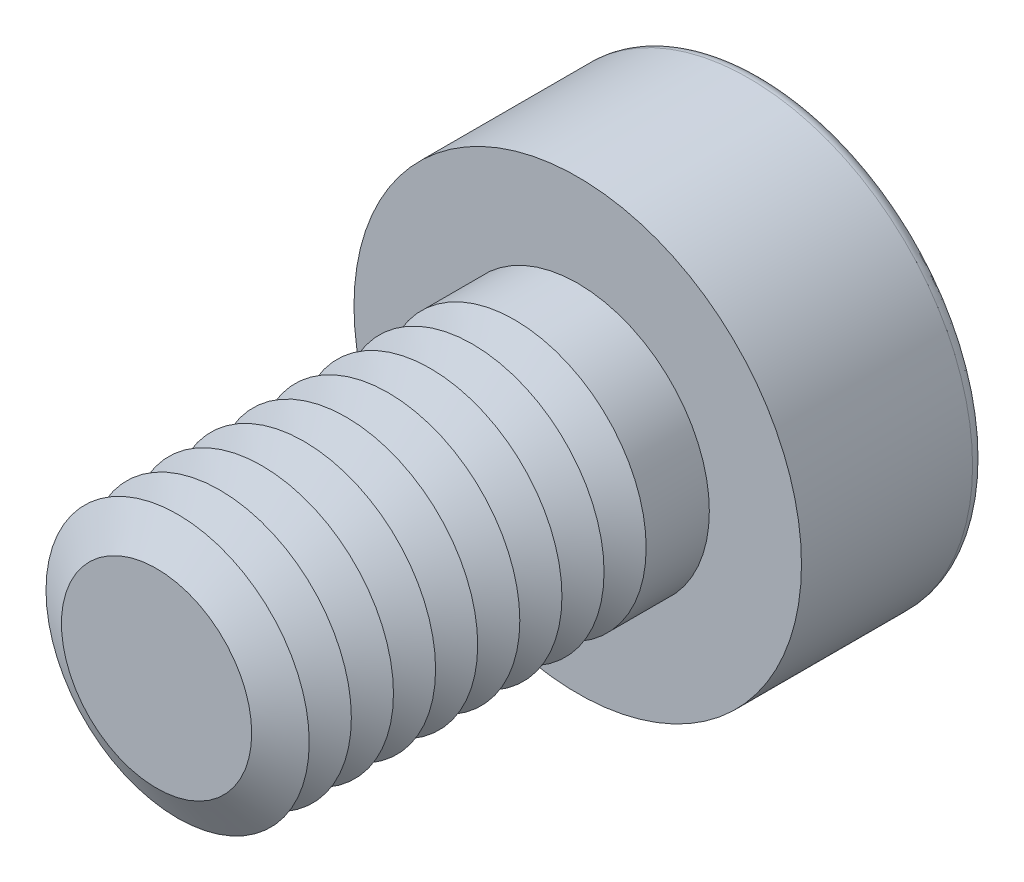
ISO-10303-21;
HEADER;
FILE_DESCRIPTION(('STEP AP214'),'2;1');
FILE_NAME('part.step','',(''),(''),'','','');
FILE_SCHEMA(('AUTOMOTIVE_DESIGN { 1 0 10303 214 1 1 1 1 }'));
ENDSEC;
DATA;
#1=APPLICATION_CONTEXT('core data for automotive mechanical design processes');
#2=APPLICATION_PROTOCOL_DEFINITION('international standard','automotive_design',2000,#1);
#3=PRODUCT_CONTEXT('',#1,'mechanical');
#4=PRODUCT('Part','Part','',(#3));
#5=PRODUCT_RELATED_PRODUCT_CATEGORY('part','',(#4));
#6=PRODUCT_DEFINITION_FORMATION('','',#4);
#7=PRODUCT_DEFINITION_CONTEXT('part definition',#1,'design');
#8=PRODUCT_DEFINITION('design','',#6,#7);
#9=PRODUCT_DEFINITION_SHAPE('','',#8);
#10=(LENGTH_UNIT() NAMED_UNIT(*) SI_UNIT(.MILLI.,.METRE.));
#11=(NAMED_UNIT(*) PLANE_ANGLE_UNIT() SI_UNIT($,.RADIAN.));
#12=(NAMED_UNIT(*) SI_UNIT($,.STERADIAN.) SOLID_ANGLE_UNIT());
#13=UNCERTAINTY_MEASURE_WITH_UNIT(LENGTH_MEASURE(1.E-05),#10,'distance_accuracy_value','');
#14=(GEOMETRIC_REPRESENTATION_CONTEXT(3) GLOBAL_UNCERTAINTY_ASSIGNED_CONTEXT((#13)) GLOBAL_UNIT_ASSIGNED_CONTEXT((#10,
#11,#12)) REPRESENTATION_CONTEXT('',''));
#15=CARTESIAN_POINT('',(0.,0.,0.));
#16=DIRECTION('',(0.,0.,1.));
#17=DIRECTION('',(1.,0.,0.));
#18=AXIS2_PLACEMENT_3D('',#15,#16,#17);
#19=CARTESIAN_POINT('',(0.,0.,5.2));
#20=DIRECTION('',(0.,0.,1.));
#21=DIRECTION('',(1.,0.,0.));
#22=AXIS2_PLACEMENT_3D('',#19,#20,#21);
#23=CONICAL_SURFACE('',#22,2.5,1.0471975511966);
#24=CARTESIAN_POINT('',(0.,0.,4.8));
#25=DIRECTION('',(0.,0.,1.));
#26=DIRECTION('',(1.,0.,0.));
#27=AXIS2_PLACEMENT_3D('',#24,#25,#26);
#28=CIRCLE('',#27,1.80717967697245);
#29=CARTESIAN_POINT('',(1.80717967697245,0.,4.8));
#30=VERTEX_POINT('',#29);
#31=EDGE_CURVE('E314',#30,#30,#28,.T.);
#32=ORIENTED_EDGE('',*,*,#31,.T.);
#33=EDGE_LOOP('',(#32));
#34=FACE_BOUND('',#33,.T.);
#35=CARTESIAN_POINT('',(0.,0.,5.2));
#36=DIRECTION('',(0.,0.,1.));
#37=DIRECTION('',(1.,0.,0.));
#38=AXIS2_PLACEMENT_3D('',#35,#36,#37);
#39=CIRCLE('',#38,2.5);
#40=CARTESIAN_POINT('',(2.5,0.,5.2));
#41=VERTEX_POINT('',#40);
#42=EDGE_CURVE('E317',#41,#41,#39,.T.);
#43=ORIENTED_EDGE('',*,*,#42,.F.);
#44=EDGE_LOOP('',(#43));
#45=FACE_BOUND('',#44,.T.);
#46=ADVANCED_FACE('F39',(#34,#45),#23,.T.);
#47=CARTESIAN_POINT('',(0.,0.,4.8));
#48=DIRECTION('',(0.,0.,-1.));
#49=DIRECTION('',(-1.,0.,0.));
#50=AXIS2_PLACEMENT_3D('',#47,#48,#49);
#51=CONICAL_SURFACE('',#50,1.80717967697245,1.0471975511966);
#52=CARTESIAN_POINT('',(0.,0.,4.4));
#53=DIRECTION('',(0.,0.,1.));
#54=DIRECTION('',(1.,0.,0.));
#55=AXIS2_PLACEMENT_3D('',#52,#53,#54);
#56=CIRCLE('',#55,2.5);
#57=CARTESIAN_POINT('',(2.5,0.,4.4));
#58=VERTEX_POINT('',#57);
#59=EDGE_CURVE('E325',#58,#58,#56,.T.);
#60=ORIENTED_EDGE('',*,*,#59,.T.);
#61=EDGE_LOOP('',(#60));
#62=FACE_BOUND('',#61,.T.);
#63=ORIENTED_EDGE('',*,*,#31,.F.);
#64=EDGE_LOOP('',(#63));
#65=FACE_BOUND('',#64,.T.);
#66=ADVANCED_FACE('F245',(#62,#65),#51,.T.);
#67=CARTESIAN_POINT('',(0.,0.,8.));
#68=DIRECTION('',(0.,0.,1.));
#69=DIRECTION('',(1.,0.,0.));
#70=AXIS2_PLACEMENT_3D('',#67,#68,#69);
#71=PLANE('',#70);
#72=CARTESIAN_POINT('',(0.,0.,8.));
#73=DIRECTION('',(0.,0.,1.));
#74=DIRECTION('',(1.,0.,0.));
#75=AXIS2_PLACEMENT_3D('',#72,#73,#74);
#76=CIRCLE('',#75,1.80717967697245);
#77=CARTESIAN_POINT('',(1.80717967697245,0.,8.));
#78=VERTEX_POINT('',#77);
#79=EDGE_CURVE('E174',#78,#78,#76,.T.);
#80=ORIENTED_EDGE('',*,*,#79,.T.);
#81=EDGE_LOOP('',(#80));
#82=FACE_BOUND('',#81,.T.);
#83=ADVANCED_FACE('F251',(#82),#71,.T.);
#84=CARTESIAN_POINT('',(0.,0.,8.));
#85=DIRECTION('',(0.,0.,-1.));
#86=DIRECTION('',(-1.,0.,0.));
#87=AXIS2_PLACEMENT_3D('',#84,#85,#86);
#88=CONICAL_SURFACE('',#87,1.80717967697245,1.0471975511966);
#89=CARTESIAN_POINT('',(0.,0.,7.6));
#90=DIRECTION('',(0.,0.,1.));
#91=DIRECTION('',(1.,0.,0.));
#92=AXIS2_PLACEMENT_3D('',#89,#90,#91);
#93=CIRCLE('',#92,2.5);
#94=CARTESIAN_POINT('',(2.5,0.,7.6));
#95=VERTEX_POINT('',#94);
#96=EDGE_CURVE('E291',#95,#95,#93,.T.);
#97=ORIENTED_EDGE('',*,*,#96,.T.);
#98=EDGE_LOOP('',(#97));
#99=FACE_BOUND('',#98,.T.);
#100=ORIENTED_EDGE('',*,*,#79,.F.);
#101=EDGE_LOOP('',(#100));
#102=FACE_BOUND('',#101,.T.);
#103=ADVANCED_FACE('F199',(#99,#102),#88,.T.);
#104=CARTESIAN_POINT('',(0.,0.,7.6));
#105=DIRECTION('',(0.,0.,1.));
#106=DIRECTION('',(1.,0.,0.));
#107=AXIS2_PLACEMENT_3D('',#104,#105,#106);
#108=CONICAL_SURFACE('',#107,2.5,1.0471975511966);
#109=CARTESIAN_POINT('',(0.,0.,7.2));
#110=DIRECTION('',(0.,0.,1.));
#111=DIRECTION('',(1.,0.,0.));
#112=AXIS2_PLACEMENT_3D('',#109,#110,#111);
#113=CIRCLE('',#112,1.80717967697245);
#114=CARTESIAN_POINT('',(1.80717967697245,0.,7.2));
#115=VERTEX_POINT('',#114);
#116=EDGE_CURVE('E288',#115,#115,#113,.T.);
#117=ORIENTED_EDGE('',*,*,#116,.T.);
#118=EDGE_LOOP('',(#117));
#119=FACE_BOUND('',#118,.T.);
#120=ORIENTED_EDGE('',*,*,#96,.F.);
#121=EDGE_LOOP('',(#120));
#122=FACE_BOUND('',#121,.T.);
#123=ADVANCED_FACE('F277',(#119,#122),#108,.T.);
#124=CARTESIAN_POINT('',(0.,0.,7.2));
#125=DIRECTION('',(0.,0.,-1.));
#126=DIRECTION('',(-1.,0.,0.));
#127=AXIS2_PLACEMENT_3D('',#124,#125,#126);
#128=CONICAL_SURFACE('',#127,1.80717967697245,1.0471975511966);
#129=CARTESIAN_POINT('',(0.,0.,6.8));
#130=DIRECTION('',(0.,0.,1.));
#131=DIRECTION('',(1.,0.,0.));
#132=AXIS2_PLACEMENT_3D('',#129,#130,#131);
#133=CIRCLE('',#132,2.5);
#134=CARTESIAN_POINT('',(2.5,0.,6.8));
#135=VERTEX_POINT('',#134);
#136=EDGE_CURVE('E300',#135,#135,#133,.T.);
#137=ORIENTED_EDGE('',*,*,#136,.T.);
#138=EDGE_LOOP('',(#137));
#139=FACE_BOUND('',#138,.T.);
#140=ORIENTED_EDGE('',*,*,#116,.F.);
#141=EDGE_LOOP('',(#140));
#142=FACE_BOUND('',#141,.T.);
#143=ADVANCED_FACE('F274',(#139,#142),#128,.T.);
#144=CARTESIAN_POINT('',(0.,0.,6.8));
#145=DIRECTION('',(0.,0.,1.));
#146=DIRECTION('',(1.,0.,0.));
#147=AXIS2_PLACEMENT_3D('',#144,#145,#146);
#148=CONICAL_SURFACE('',#147,2.5,1.0471975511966);
#149=CARTESIAN_POINT('',(0.,0.,6.4));
#150=DIRECTION('',(0.,0.,1.));
#151=DIRECTION('',(1.,0.,0.));
#152=AXIS2_PLACEMENT_3D('',#149,#150,#151);
#153=CIRCLE('',#152,1.80717967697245);
#154=CARTESIAN_POINT('',(1.80717967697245,0.,6.4));
#155=VERTEX_POINT('',#154);
#156=EDGE_CURVE('E293',#155,#155,#153,.T.);
#157=ORIENTED_EDGE('',*,*,#156,.T.);
#158=EDGE_LOOP('',(#157));
#159=FACE_BOUND('',#158,.T.);
#160=ORIENTED_EDGE('',*,*,#136,.F.);
#161=EDGE_LOOP('',(#160));
#162=FACE_BOUND('',#161,.T.);
#163=ADVANCED_FACE('F270',(#159,#162),#148,.T.);
#164=CARTESIAN_POINT('',(0.,0.,6.4));
#165=DIRECTION('',(0.,0.,-1.));
#166=DIRECTION('',(-1.,0.,0.));
#167=AXIS2_PLACEMENT_3D('',#164,#165,#166);
#168=CONICAL_SURFACE('',#167,1.80717967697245,1.0471975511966);
#169=CARTESIAN_POINT('',(0.,0.,6.));
#170=DIRECTION('',(0.,0.,1.));
#171=DIRECTION('',(1.,0.,0.));
#172=AXIS2_PLACEMENT_3D('',#169,#170,#171);
#173=CIRCLE('',#172,2.5);
#174=CARTESIAN_POINT('',(2.5,0.,6.));
#175=VERTEX_POINT('',#174);
#176=EDGE_CURVE('E310',#175,#175,#173,.T.);
#177=ORIENTED_EDGE('',*,*,#176,.T.);
#178=EDGE_LOOP('',(#177));
#179=FACE_BOUND('',#178,.T.);
#180=ORIENTED_EDGE('',*,*,#156,.F.);
#181=EDGE_LOOP('',(#180));
#182=FACE_BOUND('',#181,.T.);
#183=ADVANCED_FACE('F266',(#179,#182),#168,.T.);
#184=CARTESIAN_POINT('',(0.,0.,6.));
#185=DIRECTION('',(0.,0.,1.));
#186=DIRECTION('',(1.,0.,0.));
#187=AXIS2_PLACEMENT_3D('',#184,#185,#186);
#188=CONICAL_SURFACE('',#187,2.5,1.0471975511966);
#189=CARTESIAN_POINT('',(0.,0.,5.6));
#190=DIRECTION('',(0.,0.,1.));
#191=DIRECTION('',(1.,0.,0.));
#192=AXIS2_PLACEMENT_3D('',#189,#190,#191);
#193=CIRCLE('',#192,1.80717967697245);
#194=CARTESIAN_POINT('',(1.80717967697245,0.,5.6));
#195=VERTEX_POINT('',#194);
#196=EDGE_CURVE('E306',#195,#195,#193,.T.);
#197=ORIENTED_EDGE('',*,*,#196,.T.);
#198=EDGE_LOOP('',(#197));
#199=FACE_BOUND('',#198,.T.);
#200=ORIENTED_EDGE('',*,*,#176,.F.);
#201=EDGE_LOOP('',(#200));
#202=FACE_BOUND('',#201,.T.);
#203=ADVANCED_FACE('F262',(#199,#202),#188,.T.);
#204=CARTESIAN_POINT('',(0.,0.,5.6));
#205=DIRECTION('',(0.,0.,-1.));
#206=DIRECTION('',(-1.,0.,0.));
#207=AXIS2_PLACEMENT_3D('',#204,#205,#206);
#208=CONICAL_SURFACE('',#207,1.80717967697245,1.0471975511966);
#209=ORIENTED_EDGE('',*,*,#42,.T.);
#210=EDGE_LOOP('',(#209));
#211=FACE_BOUND('',#210,.T.);
#212=ORIENTED_EDGE('',*,*,#196,.F.);
#213=EDGE_LOOP('',(#212));
#214=FACE_BOUND('',#213,.T.);
#215=ADVANCED_FACE('F258',(#211,#214),#208,.T.);
#216=CARTESIAN_POINT('',(0.,0.,4.4));
#217=DIRECTION('',(0.,0.,1.));
#218=DIRECTION('',(1.,0.,0.));
#219=AXIS2_PLACEMENT_3D('',#216,#217,#218);
#220=CONICAL_SURFACE('',#219,2.5,1.0471975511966);
#221=CARTESIAN_POINT('',(0.,0.,4.));
#222=DIRECTION('',(0.,0.,1.));
#223=DIRECTION('',(1.,0.,0.));
#224=AXIS2_PLACEMENT_3D('',#221,#222,#223);
#225=CIRCLE('',#224,1.80717967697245);
#226=CARTESIAN_POINT('',(1.80717967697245,0.,4.));
#227=VERTEX_POINT('',#226);
#228=EDGE_CURVE('E321',#227,#227,#225,.T.);
#229=ORIENTED_EDGE('',*,*,#228,.T.);
#230=EDGE_LOOP('',(#229));
#231=FACE_BOUND('',#230,.T.);
#232=ORIENTED_EDGE('',*,*,#59,.F.);
#233=EDGE_LOOP('',(#232));
#234=FACE_BOUND('',#233,.T.);
#235=ADVANCED_FACE('F261',(#231,#234),#220,.T.);
#236=CARTESIAN_POINT('',(0.,0.,4.));
#237=DIRECTION('',(0.,0.,-1.));
#238=DIRECTION('',(-1.,0.,0.));
#239=AXIS2_PLACEMENT_3D('',#236,#237,#238);
#240=CONICAL_SURFACE('',#239,1.80717967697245,1.0471975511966);
#241=CARTESIAN_POINT('',(0.,0.,3.6));
#242=DIRECTION('',(0.,0.,1.));
#243=DIRECTION('',(1.,0.,0.));
#244=AXIS2_PLACEMENT_3D('',#241,#242,#243);
#245=CIRCLE('',#244,2.5);
#246=CARTESIAN_POINT('',(2.5,0.,3.6));
#247=VERTEX_POINT('',#246);
#248=EDGE_CURVE('E333',#247,#247,#245,.T.);
#249=ORIENTED_EDGE('',*,*,#248,.T.);
#250=EDGE_LOOP('',(#249));
#251=FACE_BOUND('',#250,.T.);
#252=ORIENTED_EDGE('',*,*,#228,.F.);
#253=EDGE_LOOP('',(#252));
#254=FACE_BOUND('',#253,.T.);
#255=ADVANCED_FACE('F385',(#251,#254),#240,.T.);
#256=CARTESIAN_POINT('',(0.,0.,3.6));
#257=DIRECTION('',(0.,0.,1.));
#258=DIRECTION('',(1.,0.,0.));
#259=AXIS2_PLACEMENT_3D('',#256,#257,#258);
#260=CONICAL_SURFACE('',#259,2.5,1.0471975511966);
#261=CARTESIAN_POINT('',(0.,0.,3.2));
#262=DIRECTION('',(0.,0.,1.));
#263=DIRECTION('',(1.,0.,0.));
#264=AXIS2_PLACEMENT_3D('',#261,#262,#263);
#265=CIRCLE('',#264,1.80717967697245);
#266=CARTESIAN_POINT('',(1.80717967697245,0.,3.2));
#267=VERTEX_POINT('',#266);
#268=EDGE_CURVE('E329',#267,#267,#265,.T.);
#269=ORIENTED_EDGE('',*,*,#268,.T.);
#270=EDGE_LOOP('',(#269));
#271=FACE_BOUND('',#270,.T.);
#272=ORIENTED_EDGE('',*,*,#248,.F.);
#273=EDGE_LOOP('',(#272));
#274=FACE_BOUND('',#273,.T.);
#275=ADVANCED_FACE('F381',(#271,#274),#260,.T.);
#276=CARTESIAN_POINT('',(0.,0.,3.2));
#277=DIRECTION('',(0.,0.,-1.));
#278=DIRECTION('',(-1.,0.,0.));
#279=AXIS2_PLACEMENT_3D('',#276,#277,#278);
#280=CONICAL_SURFACE('',#279,1.80717967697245,1.0471975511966);
#281=CARTESIAN_POINT('',(0.,0.,2.8));
#282=DIRECTION('',(0.,0.,1.));
#283=DIRECTION('',(1.,0.,0.));
#284=AXIS2_PLACEMENT_3D('',#281,#282,#283);
#285=CIRCLE('',#284,2.5);
#286=CARTESIAN_POINT('',(2.5,0.,2.8));
#287=VERTEX_POINT('',#286);
#288=EDGE_CURVE('E341',#287,#287,#285,.T.);
#289=ORIENTED_EDGE('',*,*,#288,.T.);
#290=EDGE_LOOP('',(#289));
#291=FACE_BOUND('',#290,.T.);
#292=ORIENTED_EDGE('',*,*,#268,.F.);
#293=EDGE_LOOP('',(#292));
#294=FACE_BOUND('',#293,.T.);
#295=ADVANCED_FACE('F377',(#291,#294),#280,.T.);
#296=CARTESIAN_POINT('',(0.,0.,2.8));
#297=DIRECTION('',(0.,0.,1.));
#298=DIRECTION('',(1.,0.,0.));
#299=AXIS2_PLACEMENT_3D('',#296,#297,#298);
#300=CONICAL_SURFACE('',#299,2.5,1.0471975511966);
#301=CARTESIAN_POINT('',(0.,0.,2.4));
#302=DIRECTION('',(0.,0.,1.));
#303=DIRECTION('',(1.,0.,0.));
#304=AXIS2_PLACEMENT_3D('',#301,#302,#303);
#305=CIRCLE('',#304,1.80717967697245);
#306=CARTESIAN_POINT('',(1.80717967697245,0.,2.4));
#307=VERTEX_POINT('',#306);
#308=EDGE_CURVE('E337',#307,#307,#305,.T.);
#309=ORIENTED_EDGE('',*,*,#308,.T.);
#310=EDGE_LOOP('',(#309));
#311=FACE_BOUND('',#310,.T.);
#312=ORIENTED_EDGE('',*,*,#288,.F.);
#313=EDGE_LOOP('',(#312));
#314=FACE_BOUND('',#313,.T.);
#315=ADVANCED_FACE('F372',(#311,#314),#300,.T.);
#316=CARTESIAN_POINT('',(0.,0.,2.4));
#317=DIRECTION('',(0.,0.,-1.));
#318=DIRECTION('',(-1.,0.,0.));
#319=AXIS2_PLACEMENT_3D('',#316,#317,#318);
#320=CONICAL_SURFACE('',#319,1.80717967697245,1.0471975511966);
#321=CARTESIAN_POINT('',(0.,0.,2.));
#322=DIRECTION('',(0.,0.,1.));
#323=DIRECTION('',(1.,0.,0.));
#324=AXIS2_PLACEMENT_3D('',#321,#322,#323);
#325=CIRCLE('',#324,2.5);
#326=CARTESIAN_POINT('',(2.5,0.,2.));
#327=VERTEX_POINT('',#326);
#328=EDGE_CURVE('E353',#327,#327,#325,.T.);
#329=ORIENTED_EDGE('',*,*,#328,.T.);
#330=EDGE_LOOP('',(#329));
#331=FACE_BOUND('',#330,.T.);
#332=ORIENTED_EDGE('',*,*,#308,.F.);
#333=EDGE_LOOP('',(#332));
#334=FACE_BOUND('',#333,.T.);
#335=ADVANCED_FACE('F358',(#331,#334),#320,.T.);
#336=CARTESIAN_POINT('',(0.,0.,2.));
#337=DIRECTION('',(0.,0.,1.));
#338=DIRECTION('',(1.,0.,0.));
#339=AXIS2_PLACEMENT_3D('',#336,#337,#338);
#340=CONICAL_SURFACE('',#339,2.5,1.0471975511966);
#341=CARTESIAN_POINT('',(0.,0.,1.6));
#342=DIRECTION('',(0.,0.,1.));
#343=DIRECTION('',(1.,0.,0.));
#344=AXIS2_PLACEMENT_3D('',#341,#342,#343);
#345=CIRCLE('',#344,1.80717967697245);
#346=CARTESIAN_POINT('',(1.80717967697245,0.,1.6));
#347=VERTEX_POINT('',#346);
#348=EDGE_CURVE('E345',#347,#347,#345,.T.);
#349=ORIENTED_EDGE('',*,*,#348,.T.);
#350=EDGE_LOOP('',(#349));
#351=FACE_BOUND('',#350,.T.);
#352=ORIENTED_EDGE('',*,*,#328,.F.);
#353=EDGE_LOOP('',(#352));
#354=FACE_BOUND('',#353,.T.);
#355=ADVANCED_FACE('F361',(#351,#354),#340,.T.);
#356=CARTESIAN_POINT('',(0.,0.,1.6));
#357=DIRECTION('',(0.,0.,-1.));
#358=DIRECTION('',(-1.,0.,0.));
#359=AXIS2_PLACEMENT_3D('',#356,#357,#358);
#360=CONICAL_SURFACE('',#359,1.80717967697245,1.0471975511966);
#361=CARTESIAN_POINT('',(0.,0.,1.2));
#362=DIRECTION('',(0.,0.,1.));
#363=DIRECTION('',(1.,0.,0.));
#364=AXIS2_PLACEMENT_3D('',#361,#362,#363);
#365=CIRCLE('',#364,2.5);
#366=CARTESIAN_POINT('',(2.5,0.,1.2));
#367=VERTEX_POINT('',#366);
#368=EDGE_CURVE('E349',#367,#367,#365,.T.);
#369=ORIENTED_EDGE('',*,*,#368,.T.);
#370=EDGE_LOOP('',(#369));
#371=FACE_BOUND('',#370,.T.);
#372=ORIENTED_EDGE('',*,*,#348,.F.);
#373=EDGE_LOOP('',(#372));
#374=FACE_BOUND('',#373,.T.);
#375=ADVANCED_FACE('F363',(#371,#374),#360,.T.);
#376=CARTESIAN_POINT('',(0.,0.,-1.25));
#377=DIRECTION('',(0.,0.,-1.));
#378=DIRECTION('',(-1.,0.,0.));
#379=AXIS2_PLACEMENT_3D('',#376,#377,#378);
#380=CONICAL_SURFACE('',#379,1.5,1.0471975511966);
#381=CARTESIAN_POINT('',(0.,0.,-0.383974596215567));
#382=VERTEX_POINT('',#381);
#383=VERTEX_LOOP('',#382);
#384=FACE_BOUND('',#383,.T.);
#385=CARTESIAN_POINT('',(0.,0.,-1.25));
#386=DIRECTION('',(0.,0.,-1.));
#387=DIRECTION('',(-1.,0.,0.));
#388=AXIS2_PLACEMENT_3D('',#385,#386,#387);
#389=CIRCLE('',#388,1.5);
#390=CARTESIAN_POINT('',(-1.29903810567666,0.749999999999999,-1.25));
#391=VERTEX_POINT('',#390);
#392=CARTESIAN_POINT('',(0.,1.5,-1.25));
#393=VERTEX_POINT('',#392);
#394=EDGE_CURVE('E149',#391,#393,#389,.T.);
#395=ORIENTED_EDGE('',*,*,#394,.T.);
#396=CARTESIAN_POINT('',(0.,0.,-1.25));
#397=DIRECTION('',(0.,0.,-1.));
#398=DIRECTION('',(-1.,0.,0.));
#399=AXIS2_PLACEMENT_3D('',#396,#397,#398);
#400=CIRCLE('',#399,1.5);
#401=CARTESIAN_POINT('',(1.29903810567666,0.75,-1.25));
#402=VERTEX_POINT('',#401);
#403=EDGE_CURVE('E54',#393,#402,#400,.T.);
#404=ORIENTED_EDGE('',*,*,#403,.T.);
#405=CARTESIAN_POINT('',(1.29903810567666,-0.75,-1.25));
#406=VERTEX_POINT('',#405);
#407=EDGE_CURVE('E786',#402,#406,#400,.T.);
#408=ORIENTED_EDGE('',*,*,#407,.T.);
#409=CARTESIAN_POINT('',(0.,-1.5,-1.25));
#410=VERTEX_POINT('',#409);
#411=EDGE_CURVE('E785',#406,#410,#400,.T.);
#412=ORIENTED_EDGE('',*,*,#411,.T.);
#413=CARTESIAN_POINT('',(-1.29903810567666,-0.749999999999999,-1.25));
#414=VERTEX_POINT('',#413);
#415=EDGE_CURVE('E780',#410,#414,#400,.T.);
#416=ORIENTED_EDGE('',*,*,#415,.T.);
#417=EDGE_CURVE('E778',#414,#391,#400,.T.);
#418=ORIENTED_EDGE('',*,*,#417,.T.);
#419=EDGE_LOOP('',(#395,#404,#408,#412,#416,#418));
#420=FACE_BOUND('',#419,.T.);
#421=ADVANCED_FACE('F201',(#384,#420),#380,.F.);
#422=CARTESIAN_POINT('',(0.,0.,-1.25));
#423=DIRECTION('',(0.,0.,-1.));
#424=DIRECTION('',(-1.,0.,0.));
#425=AXIS2_PLACEMENT_3D('',#422,#423,#424);
#426=PLANE('',#425);
#427=ORIENTED_EDGE('',*,*,#403,.F.);
#428=DIRECTION('',(1.,0.,0.));
#429=VECTOR('',#428,1.);
#430=CARTESIAN_POINT('',(-0.866025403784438,1.5,-1.25));
#431=LINE('',#430,#429);
#432=CARTESIAN_POINT('',(0.86602540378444,1.5,-1.25));
#433=VERTEX_POINT('',#432);
#434=EDGE_CURVE('E825',#393,#433,#431,.T.);
#435=ORIENTED_EDGE('',*,*,#434,.T.);
#436=DIRECTION('',(0.5,-0.866025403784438,0.));
#437=VECTOR('',#436,1.);
#438=CARTESIAN_POINT('',(0.86602540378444,1.5,-1.25));
#439=LINE('',#438,#437);
#440=EDGE_CURVE('E155',#433,#402,#439,.T.);
#441=ORIENTED_EDGE('',*,*,#440,.T.);
#442=EDGE_LOOP('',(#427,#435,#441));
#443=FACE_BOUND('',#442,.T.);
#444=ADVANCED_FACE('F432',(#443),#426,.T.);
#445=ORIENTED_EDGE('',*,*,#407,.F.);
#446=CARTESIAN_POINT('',(1.73205080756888,0.,-1.25));
#447=VERTEX_POINT('',#446);
#448=EDGE_CURVE('E826',#402,#447,#439,.T.);
#449=ORIENTED_EDGE('',*,*,#448,.T.);
#450=DIRECTION('',(-0.5,-0.866025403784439,0.));
#451=VECTOR('',#450,1.);
#452=CARTESIAN_POINT('',(1.73205080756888,0.,-1.25));
#453=LINE('',#452,#451);
#454=EDGE_CURVE('E799',#447,#406,#453,.T.);
#455=ORIENTED_EDGE('',*,*,#454,.T.);
#456=EDGE_LOOP('',(#445,#449,#455));
#457=FACE_BOUND('',#456,.T.);
#458=ADVANCED_FACE('F442',(#457),#426,.T.);
#459=ORIENTED_EDGE('',*,*,#411,.F.);
#460=CARTESIAN_POINT('',(0.86602540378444,-1.5,-1.25));
#461=VERTEX_POINT('',#460);
#462=EDGE_CURVE('E801',#406,#461,#453,.T.);
#463=ORIENTED_EDGE('',*,*,#462,.T.);
#464=DIRECTION('',(-1.,0.,0.));
#465=VECTOR('',#464,1.);
#466=CARTESIAN_POINT('',(0.86602540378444,-1.5,-1.25));
#467=LINE('',#466,#465);
#468=EDGE_CURVE('E754',#461,#410,#467,.T.);
#469=ORIENTED_EDGE('',*,*,#468,.T.);
#470=EDGE_LOOP('',(#459,#463,#469));
#471=FACE_BOUND('',#470,.T.);
#472=ADVANCED_FACE('F452',(#471),#426,.T.);
#473=ORIENTED_EDGE('',*,*,#415,.F.);
#474=CARTESIAN_POINT('',(-0.866025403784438,-1.5,-1.25));
#475=VERTEX_POINT('',#474);
#476=EDGE_CURVE('E795',#410,#475,#467,.T.);
#477=ORIENTED_EDGE('',*,*,#476,.T.);
#478=DIRECTION('',(-0.5,0.866025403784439,0.));
#479=VECTOR('',#478,1.);
#480=CARTESIAN_POINT('',(-0.866025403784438,-1.5,-1.25));
#481=LINE('',#480,#479);
#482=EDGE_CURVE('E797',#475,#414,#481,.T.);
#483=ORIENTED_EDGE('',*,*,#482,.T.);
#484=EDGE_LOOP('',(#473,#477,#483));
#485=FACE_BOUND('',#484,.T.);
#486=ADVANCED_FACE('F460',(#485),#426,.T.);
#487=ORIENTED_EDGE('',*,*,#417,.F.);
#488=CARTESIAN_POINT('',(-1.73205080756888,0.,-1.25));
#489=VERTEX_POINT('',#488);
#490=EDGE_CURVE('E803',#414,#489,#481,.T.);
#491=ORIENTED_EDGE('',*,*,#490,.T.);
#492=DIRECTION('',(0.5,0.866025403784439,0.));
#493=VECTOR('',#492,1.);
#494=CARTESIAN_POINT('',(-1.73205080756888,0.,-1.25));
#495=LINE('',#494,#493);
#496=EDGE_CURVE('E158',#489,#391,#495,.T.);
#497=ORIENTED_EDGE('',*,*,#496,.T.);
#498=EDGE_LOOP('',(#487,#491,#497));
#499=FACE_BOUND('',#498,.T.);
#500=ADVANCED_FACE('F231',(#499),#426,.T.);
#501=ORIENTED_EDGE('',*,*,#394,.F.);
#502=CARTESIAN_POINT('',(-0.866025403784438,1.5,-1.25));
#503=VERTEX_POINT('',#502);
#504=EDGE_CURVE('E810',#391,#503,#495,.T.);
#505=ORIENTED_EDGE('',*,*,#504,.T.);
#506=EDGE_CURVE('E824',#503,#393,#431,.T.);
#507=ORIENTED_EDGE('',*,*,#506,.T.);
#508=EDGE_LOOP('',(#501,#505,#507));
#509=FACE_BOUND('',#508,.T.);
#510=ADVANCED_FACE('F444',(#509),#426,.T.);
#511=CARTESIAN_POINT('',(-0.866025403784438,1.5,-1.25));
#512=DIRECTION('',(0.,1.,0.));
#513=DIRECTION('',(-1.,0.,0.));
#514=AXIS2_PLACEMENT_3D('',#511,#512,#513);
#515=PLANE('',#514);
#516=DIRECTION('',(0.,0.,-1.));
#517=VECTOR('',#516,1.);
#518=CARTESIAN_POINT('',(-0.866025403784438,1.5,-1.25));
#519=LINE('',#518,#517);
#520=CARTESIAN_POINT('',(-0.866025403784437,1.5,-3.5));
#521=VERTEX_POINT('',#520);
#522=EDGE_CURVE('E147',#503,#521,#519,.T.);
#523=ORIENTED_EDGE('',*,*,#522,.T.);
#524=CARTESIAN_POINT('',(-2.26080568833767,1.5,-3.76288767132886));
#525=CARTESIAN_POINT('',(-2.19307335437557,1.5,-3.74776718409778));
#526=CARTESIAN_POINT('',(-2.12529797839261,1.5,-3.73283936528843));
#527=CARTESIAN_POINT('',(-1.989639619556,1.5,-3.7034664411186));
#528=CARTESIAN_POINT('',(-1.92175663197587,1.5,-3.6890213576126));
#529=CARTESIAN_POINT('',(-1.71778516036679,1.5,-3.6465295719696));
#530=CARTESIAN_POINT('',(-1.58151166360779,1.5,-3.61935744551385));
#531=CARTESIAN_POINT('',(-1.30947840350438,1.5,-3.56878855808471));
#532=CARTESIAN_POINT('',(-1.17372447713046,1.5,-3.54536102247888));
#533=CARTESIAN_POINT('',(-0.90140428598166,1.5,-3.50385032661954));
#534=CARTESIAN_POINT('',(-0.764838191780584,1.5,-3.48576608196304));
#535=CARTESIAN_POINT('',(-0.489293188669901,1.5,-3.45729203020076));
#536=CARTESIAN_POINT('',(-0.350304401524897,1.5,-3.44699084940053));
#537=CARTESIAN_POINT('',(-0.14157144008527,1.5,-3.43918165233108));
#538=CARTESIAN_POINT('',(-0.0719628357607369,1.5,-3.43785196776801));
#539=CARTESIAN_POINT('',(0.0672555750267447,1.5,-3.43779336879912));
#540=CARTESIAN_POINT('',(0.136865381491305,1.5,-3.43906445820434));
#541=CARTESIAN_POINT('',(0.346114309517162,1.5,-3.44672257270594));
#542=CARTESIAN_POINT('',(0.48561964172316,1.5,-3.45697478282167));
#543=CARTESIAN_POINT('',(0.76382969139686,1.5,-3.48560011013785));
#544=CARTESIAN_POINT('',(0.902533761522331,1.5,-3.50397905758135));
#545=CARTESIAN_POINT('',(1.18270277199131,1.5,-3.54677522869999));
#546=CARTESIAN_POINT('',(1.32414472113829,1.5,-3.57133816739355));
#547=CARTESIAN_POINT('',(1.60634089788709,1.5,-3.62417713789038));
#548=CARTESIAN_POINT('',(1.74709501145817,1.5,-3.65245376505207));
#549=CARTESIAN_POINT('',(2.02813527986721,1.5,-3.71141289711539));
#550=CARTESIAN_POINT('',(2.16842128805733,1.5,-3.74209609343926));
#551=CARTESIAN_POINT('',(2.44863558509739,1.5,-3.80505759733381));
#552=CARTESIAN_POINT('',(2.5885638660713,1.5,-3.8373359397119));
#553=CARTESIAN_POINT('',(2.86645602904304,1.5,-3.90258693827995));
#554=CARTESIAN_POINT('',(3.0044230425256,1.5,-3.93554631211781));
#555=CARTESIAN_POINT('',(3.28017563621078,1.5,-4.00222717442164));
#556=CARTESIAN_POINT('',(3.41796121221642,1.5,-4.03594868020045));
#557=CARTESIAN_POINT('',(3.69320305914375,1.5,-4.10389962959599));
#558=CARTESIAN_POINT('',(3.83065952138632,1.5,-4.13812829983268));
#559=CARTESIAN_POINT('',(4.10546119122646,1.5,-4.20700872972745));
#560=CARTESIAN_POINT('',(4.24280640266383,1.5,-4.2416604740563));
#561=CARTESIAN_POINT('',(4.38011382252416,1.5,-4.27645965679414));
#562=B_SPLINE_CURVE_WITH_KNOTS('',3,(#524,#525,#526,#527,#528,#529,#530,#531,#532,#533,#534,
#535,#536,#537,#538,#539,#540,#541,#542,#543,#544,#545,#546,#547,#548,#549,#550,#551,#552,#553,
#554,#555,#556,#557,#558,#559,#560,#561),.UNSPECIFIED.,.F.,.F.,(4,2,2,2,2,2,2,2,2,2,2,2,2,2,2,2,
2,2,4),(0.,0.208198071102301,0.416405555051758,0.833243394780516,1.2464565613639,
1.65958581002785,2.07735129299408,2.28617008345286,2.49498917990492,2.91428402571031,
3.33388016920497,3.76448033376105,4.19514961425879,4.62594308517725,5.05674596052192,
5.48229088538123,5.90784548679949,6.33280701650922,6.75775319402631),.UNSPECIFIED.);
#563=CARTESIAN_POINT('',(0.866025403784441,1.5,-3.5));
#564=VERTEX_POINT('',#563);
#565=EDGE_CURVE('E124',#521,#564,#562,.T.);
#566=ORIENTED_EDGE('',*,*,#565,.T.);
#567=DIRECTION('',(0.,0.,-1.));
#568=VECTOR('',#567,1.);
#569=CARTESIAN_POINT('',(0.86602540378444,1.5,-1.25));
#570=LINE('',#569,#568);
#571=EDGE_CURVE('E143',#433,#564,#570,.T.);
#572=ORIENTED_EDGE('',*,*,#571,.F.);
#573=ORIENTED_EDGE('',*,*,#434,.F.);
#574=ORIENTED_EDGE('',*,*,#506,.F.);
#575=EDGE_LOOP('',(#523,#566,#572,#573,#574));
#576=FACE_BOUND('',#575,.T.);
#577=ADVANCED_FACE('F141',(#576),#515,.F.);
#578=CARTESIAN_POINT('',(0.86602540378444,1.5,-1.25));
#579=DIRECTION('',(0.866025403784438,0.5,0.));
#580=DIRECTION('',(-0.5,0.866025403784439,0.));
#581=AXIS2_PLACEMENT_3D('',#578,#579,#580);
#582=PLANE('',#581);
#583=ORIENTED_EDGE('',*,*,#571,.T.);
#584=CARTESIAN_POINT('',(0.865909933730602,1.5002,-3.50003094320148));
#585=CARTESIAN_POINT('',(0.901883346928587,1.43789222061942,-3.49038632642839));
#586=CARTESIAN_POINT('',(0.937921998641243,1.37547144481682,-3.48163049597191));
#587=CARTESIAN_POINT('',(1.01012661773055,1.25040937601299,-3.46624719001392));
#588=CARTESIAN_POINT('',(1.04629263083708,1.18776800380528,-3.4596205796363));
#589=CARTESIAN_POINT('',(1.11853262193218,1.06264466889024,-3.44888268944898));
#590=CARTESIAN_POINT('',(1.15460611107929,1.00016355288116,-3.44475860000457));
#591=CARTESIAN_POINT('',(1.22679910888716,0.875121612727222,-3.43922860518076));
#592=CARTESIAN_POINT('',(1.26291860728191,0.812560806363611,-3.43782217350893));
#593=CARTESIAN_POINT('',(1.33515760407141,0.68743919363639,-3.43782217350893));
#594=CARTESIAN_POINT('',(1.37127710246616,0.62487838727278,-3.43922860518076));
#595=CARTESIAN_POINT('',(1.44347010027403,0.49983644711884,-3.44475860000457));
#596=CARTESIAN_POINT('',(1.47954358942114,0.437355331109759,-3.44888268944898));
#597=CARTESIAN_POINT('',(1.55178358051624,0.312231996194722,-3.4596205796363));
#598=CARTESIAN_POINT('',(1.58794959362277,0.249590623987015,-3.46624719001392));
#599=CARTESIAN_POINT('',(1.66015421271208,0.124528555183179,-3.48163049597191));
#600=CARTESIAN_POINT('',(1.69619286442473,0.0621077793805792,-3.49038632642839));
#601=CARTESIAN_POINT('',(1.73216627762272,-0.000199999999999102,-3.50003094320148));
#602=B_SPLINE_CURVE_WITH_KNOTS('',3,(#584,#585,#586,#587,#588,#589,#590,#591,#592,#593,#594,
#595,#596,#597,#598,#599,#600,#601),.UNSPECIFIED.,.F.,.F.,(4,2,2,2,2,2,2,2,4),(0.,
0.217782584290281,0.435653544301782,0.652399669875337,0.869103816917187,1.08580796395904,
1.30255408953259,1.52042504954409,1.73820763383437),.UNSPECIFIED.);
#603=CARTESIAN_POINT('',(1.73205080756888,0.,-3.5));
#604=VERTEX_POINT('',#603);
#605=EDGE_CURVE('E11',#564,#604,#602,.T.);
#606=ORIENTED_EDGE('',*,*,#605,.T.);
#607=DIRECTION('',(0.,0.,-1.));
#608=VECTOR('',#607,1.);
#609=CARTESIAN_POINT('',(1.73205080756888,0.,-1.25));
#610=LINE('',#609,#608);
#611=EDGE_CURVE('E157',#447,#604,#610,.T.);
#612=ORIENTED_EDGE('',*,*,#611,.F.);
#613=ORIENTED_EDGE('',*,*,#448,.F.);
#614=ORIENTED_EDGE('',*,*,#440,.F.);
#615=EDGE_LOOP('',(#583,#606,#612,#613,#614));
#616=FACE_BOUND('',#615,.T.);
#617=ADVANCED_FACE('F152',(#616),#582,.F.);
#618=CARTESIAN_POINT('',(1.73205080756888,0.,-1.25));
#619=DIRECTION('',(0.866025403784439,-0.5,0.));
#620=DIRECTION('',(0.5,0.866025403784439,0.));
#621=AXIS2_PLACEMENT_3D('',#618,#619,#620);
#622=PLANE('',#621);
#623=ORIENTED_EDGE('',*,*,#611,.T.);
#624=CARTESIAN_POINT('',(1.73216627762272,0.000200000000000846,-3.50003094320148));
#625=CARTESIAN_POINT('',(1.69619286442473,-0.0621077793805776,-3.49038632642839));
#626=CARTESIAN_POINT('',(1.66015421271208,-0.124528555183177,-3.48163049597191));
#627=CARTESIAN_POINT('',(1.58794959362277,-0.249590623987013,-3.46624719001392));
#628=CARTESIAN_POINT('',(1.55178358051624,-0.312231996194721,-3.4596205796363));
#629=CARTESIAN_POINT('',(1.47954358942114,-0.437355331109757,-3.44888268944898));
#630=CARTESIAN_POINT('',(1.44347010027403,-0.499836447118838,-3.44475860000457));
#631=CARTESIAN_POINT('',(1.37127710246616,-0.624878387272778,-3.43922860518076));
#632=CARTESIAN_POINT('',(1.33515760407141,-0.687439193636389,-3.43782217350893));
#633=CARTESIAN_POINT('',(1.26291860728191,-0.81256080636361,-3.43782217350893));
#634=CARTESIAN_POINT('',(1.22679910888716,-0.87512161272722,-3.43922860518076));
#635=CARTESIAN_POINT('',(1.15460611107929,-1.00016355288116,-3.44475860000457));
#636=CARTESIAN_POINT('',(1.11853262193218,-1.06264466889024,-3.44888268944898));
#637=CARTESIAN_POINT('',(1.04629263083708,-1.18776800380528,-3.4596205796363));
#638=CARTESIAN_POINT('',(1.01012661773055,-1.25040937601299,-3.46624719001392));
#639=CARTESIAN_POINT('',(0.937921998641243,-1.37547144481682,-3.48163049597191));
#640=CARTESIAN_POINT('',(0.901883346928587,-1.43789222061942,-3.49038632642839));
#641=CARTESIAN_POINT('',(0.865909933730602,-1.5002,-3.50003094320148));
#642=B_SPLINE_CURVE_WITH_KNOTS('',3,(#624,#625,#626,#627,#628,#629,#630,#631,#632,#633,#634,
#635,#636,#637,#638,#639,#640,#641),.UNSPECIFIED.,.F.,.F.,(4,2,2,2,2,2,2,2,4),(0.,
0.217782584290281,0.435653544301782,0.652399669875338,0.869103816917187,1.08580796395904,
1.30255408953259,1.52042504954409,1.73820763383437),.UNSPECIFIED.);
#643=CARTESIAN_POINT('',(0.86602540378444,-1.5,-3.5));
#644=VERTEX_POINT('',#643);
#645=EDGE_CURVE('E173',#604,#644,#642,.T.);
#646=ORIENTED_EDGE('',*,*,#645,.T.);
#647=DIRECTION('',(0.,0.,-1.));
#648=VECTOR('',#647,1.);
#649=CARTESIAN_POINT('',(0.86602540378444,-1.5,-1.25));
#650=LINE('',#649,#648);
#651=EDGE_CURVE('E749',#461,#644,#650,.T.);
#652=ORIENTED_EDGE('',*,*,#651,.F.);
#653=ORIENTED_EDGE('',*,*,#462,.F.);
#654=ORIENTED_EDGE('',*,*,#454,.F.);
#655=EDGE_LOOP('',(#623,#646,#652,#653,#654));
#656=FACE_BOUND('',#655,.T.);
#657=ADVANCED_FACE('F191',(#656),#622,.F.);
#658=CARTESIAN_POINT('',(0.86602540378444,-1.5,-1.25));
#659=DIRECTION('',(0.,-1.,0.));
#660=DIRECTION('',(0.,0.,-1.));
#661=AXIS2_PLACEMENT_3D('',#658,#659,#660);
#662=PLANE('',#661);
#663=ORIENTED_EDGE('',*,*,#651,.T.);
#664=CARTESIAN_POINT('',(-2.26080568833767,-1.5,-3.76288767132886));
#665=CARTESIAN_POINT('',(-2.19307335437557,-1.5,-3.74776718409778));
#666=CARTESIAN_POINT('',(-2.12529797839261,-1.5,-3.73283936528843));
#667=CARTESIAN_POINT('',(-1.989639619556,-1.5,-3.7034664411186));
#668=CARTESIAN_POINT('',(-1.92175663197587,-1.5,-3.6890213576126));
#669=CARTESIAN_POINT('',(-1.71778516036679,-1.5,-3.6465295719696));
#670=CARTESIAN_POINT('',(-1.58151166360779,-1.5,-3.61935744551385));
#671=CARTESIAN_POINT('',(-1.30947840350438,-1.5,-3.56878855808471));
#672=CARTESIAN_POINT('',(-1.17372447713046,-1.5,-3.54536102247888));
#673=CARTESIAN_POINT('',(-0.90140428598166,-1.5,-3.50385032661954));
#674=CARTESIAN_POINT('',(-0.764838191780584,-1.5,-3.48576608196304));
#675=CARTESIAN_POINT('',(-0.489293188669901,-1.5,-3.45729203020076));
#676=CARTESIAN_POINT('',(-0.350304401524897,-1.5,-3.44699084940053));
#677=CARTESIAN_POINT('',(-0.14157144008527,-1.5,-3.43918165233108));
#678=CARTESIAN_POINT('',(-0.0719628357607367,-1.5,-3.43785196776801));
#679=CARTESIAN_POINT('',(0.0672555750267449,-1.5,-3.43779336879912));
#680=CARTESIAN_POINT('',(0.136865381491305,-1.5,-3.43906445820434));
#681=CARTESIAN_POINT('',(0.346114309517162,-1.5,-3.44672257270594));
#682=CARTESIAN_POINT('',(0.48561964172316,-1.5,-3.45697478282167));
#683=CARTESIAN_POINT('',(0.76382969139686,-1.5,-3.48560011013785));
#684=CARTESIAN_POINT('',(0.902533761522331,-1.5,-3.50397905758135));
#685=CARTESIAN_POINT('',(1.18270277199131,-1.5,-3.54677522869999));
#686=CARTESIAN_POINT('',(1.32414472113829,-1.5,-3.57133816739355));
#687=CARTESIAN_POINT('',(1.60634089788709,-1.5,-3.62417713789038));
#688=CARTESIAN_POINT('',(1.74709501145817,-1.5,-3.65245376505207));
#689=CARTESIAN_POINT('',(2.02813527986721,-1.5,-3.71141289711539));
#690=CARTESIAN_POINT('',(2.16842128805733,-1.5,-3.74209609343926));
#691=CARTESIAN_POINT('',(2.44863558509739,-1.5,-3.80505759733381));
#692=CARTESIAN_POINT('',(2.5885638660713,-1.5,-3.8373359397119));
#693=CARTESIAN_POINT('',(2.86645602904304,-1.5,-3.90258693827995));
#694=CARTESIAN_POINT('',(3.0044230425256,-1.5,-3.93554631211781));
#695=CARTESIAN_POINT('',(3.28017563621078,-1.5,-4.00222717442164));
#696=CARTESIAN_POINT('',(3.41796121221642,-1.5,-4.03594868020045));
#697=CARTESIAN_POINT('',(3.69320305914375,-1.5,-4.10389962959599));
#698=CARTESIAN_POINT('',(3.83065952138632,-1.5,-4.13812829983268));
#699=CARTESIAN_POINT('',(4.10546119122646,-1.5,-4.20700872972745));
#700=CARTESIAN_POINT('',(4.24280640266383,-1.5,-4.2416604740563));
#701=CARTESIAN_POINT('',(4.38011382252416,-1.5,-4.27645965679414));
#702=B_SPLINE_CURVE_WITH_KNOTS('',3,(#664,#665,#666,#667,#668,#669,#670,#671,#672,#673,#674,
#675,#676,#677,#678,#679,#680,#681,#682,#683,#684,#685,#686,#687,#688,#689,#690,#691,#692,#693,
#694,#695,#696,#697,#698,#699,#700,#701),.UNSPECIFIED.,.F.,.F.,(4,2,2,2,2,2,2,2,2,2,2,2,2,2,2,2,
2,2,4),(0.,0.208198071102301,0.416405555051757,0.833243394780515,1.2464565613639,
1.65958581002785,2.07735129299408,2.28617008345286,2.49498917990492,2.91428402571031,
3.33388016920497,3.76448033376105,4.19514961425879,4.62594308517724,5.05674596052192,
5.48229088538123,5.90784548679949,6.33280701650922,6.75775319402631),.UNSPECIFIED.);
#703=CARTESIAN_POINT('',(-0.866025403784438,-1.5,-3.5));
#704=VERTEX_POINT('',#703);
#705=EDGE_CURVE('E184',#644,#704,#702,.F.);
#706=ORIENTED_EDGE('',*,*,#705,.T.);
#707=DIRECTION('',(0.,0.,-1.));
#708=VECTOR('',#707,1.);
#709=CARTESIAN_POINT('',(-0.866025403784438,-1.5,-1.25));
#710=LINE('',#709,#708);
#711=EDGE_CURVE('E756',#475,#704,#710,.T.);
#712=ORIENTED_EDGE('',*,*,#711,.F.);
#713=ORIENTED_EDGE('',*,*,#476,.F.);
#714=ORIENTED_EDGE('',*,*,#468,.F.);
#715=EDGE_LOOP('',(#663,#706,#712,#713,#714));
#716=FACE_BOUND('',#715,.T.);
#717=ADVANCED_FACE('F234',(#716),#662,.F.);
#718=CARTESIAN_POINT('',(-0.866025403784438,-1.5,-1.25));
#719=DIRECTION('',(-0.866025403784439,-0.5,0.));
#720=DIRECTION('',(0.5,-0.866025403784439,0.));
#721=AXIS2_PLACEMENT_3D('',#718,#719,#720);
#722=PLANE('',#721);
#723=ORIENTED_EDGE('',*,*,#711,.T.);
#724=CARTESIAN_POINT('',(-0.8659099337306,-1.5002,-3.50003094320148));
#725=CARTESIAN_POINT('',(-0.901883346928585,-1.43789222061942,-3.49038632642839));
#726=CARTESIAN_POINT('',(-0.937921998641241,-1.37547144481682,-3.48163049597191));
#727=CARTESIAN_POINT('',(-1.01012661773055,-1.25040937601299,-3.46624719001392));
#728=CARTESIAN_POINT('',(-1.04629263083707,-1.18776800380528,-3.4596205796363));
#729=CARTESIAN_POINT('',(-1.11853262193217,-1.06264466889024,-3.44888268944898));
#730=CARTESIAN_POINT('',(-1.15460611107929,-1.00016355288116,-3.44475860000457));
#731=CARTESIAN_POINT('',(-1.22679910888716,-0.875121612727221,-3.43922860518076));
#732=CARTESIAN_POINT('',(-1.26291860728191,-0.81256080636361,-3.43782217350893));
#733=CARTESIAN_POINT('',(-1.33515760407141,-0.68743919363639,-3.43782217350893));
#734=CARTESIAN_POINT('',(-1.37127710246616,-0.624878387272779,-3.43922860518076));
#735=CARTESIAN_POINT('',(-1.44347010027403,-0.499836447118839,-3.44475860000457));
#736=CARTESIAN_POINT('',(-1.47954358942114,-0.437355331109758,-3.44888268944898));
#737=CARTESIAN_POINT('',(-1.55178358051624,-0.312231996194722,-3.4596205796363));
#738=CARTESIAN_POINT('',(-1.58794959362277,-0.249590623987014,-3.46624719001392));
#739=CARTESIAN_POINT('',(-1.66015421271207,-0.124528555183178,-3.48163049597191));
#740=CARTESIAN_POINT('',(-1.69619286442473,-0.0621077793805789,-3.49038632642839));
#741=CARTESIAN_POINT('',(-1.73216627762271,0.000199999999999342,-3.50003094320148));
#742=B_SPLINE_CURVE_WITH_KNOTS('',3,(#724,#725,#726,#727,#728,#729,#730,#731,#732,#733,#734,
#735,#736,#737,#738,#739,#740,#741),.UNSPECIFIED.,.F.,.F.,(4,2,2,2,2,2,2,2,4),(0.,
0.217782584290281,0.435653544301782,0.652399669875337,0.869103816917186,1.08580796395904,
1.30255408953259,1.52042504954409,1.73820763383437),.UNSPECIFIED.);
#743=CARTESIAN_POINT('',(-1.73205080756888,0.,-3.5));
#744=VERTEX_POINT('',#743);
#745=EDGE_CURVE('E208',#704,#744,#742,.T.);
#746=ORIENTED_EDGE('',*,*,#745,.T.);
#747=DIRECTION('',(0.,0.,-1.));
#748=VECTOR('',#747,1.);
#749=CARTESIAN_POINT('',(-1.73205080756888,0.,-1.25));
#750=LINE('',#749,#748);
#751=EDGE_CURVE('E759',#489,#744,#750,.T.);
#752=ORIENTED_EDGE('',*,*,#751,.F.);
#753=ORIENTED_EDGE('',*,*,#490,.F.);
#754=ORIENTED_EDGE('',*,*,#482,.F.);
#755=EDGE_LOOP('',(#723,#746,#752,#753,#754));
#756=FACE_BOUND('',#755,.T.);
#757=ADVANCED_FACE('F229',(#756),#722,.F.);
#758=CARTESIAN_POINT('',(-1.73205080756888,0.,-1.25));
#759=DIRECTION('',(-0.866025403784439,0.5,0.));
#760=DIRECTION('',(-0.5,-0.866025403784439,0.));
#761=AXIS2_PLACEMENT_3D('',#758,#759,#760);
#762=PLANE('',#761);
#763=ORIENTED_EDGE('',*,*,#751,.T.);
#764=CARTESIAN_POINT('',(-1.73216627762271,-0.000200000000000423,-3.50003094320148));
#765=CARTESIAN_POINT('',(-1.69619286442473,0.0621077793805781,-3.49038632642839));
#766=CARTESIAN_POINT('',(-1.66015421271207,0.124528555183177,-3.48163049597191));
#767=CARTESIAN_POINT('',(-1.58794959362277,0.249590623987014,-3.46624719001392));
#768=CARTESIAN_POINT('',(-1.55178358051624,0.312231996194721,-3.4596205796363));
#769=CARTESIAN_POINT('',(-1.47954358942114,0.437355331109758,-3.44888268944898));
#770=CARTESIAN_POINT('',(-1.44347010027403,0.499836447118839,-3.44475860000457));
#771=CARTESIAN_POINT('',(-1.37127710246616,0.624878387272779,-3.43922860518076));
#772=CARTESIAN_POINT('',(-1.33515760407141,0.687439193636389,-3.43782217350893));
#773=CARTESIAN_POINT('',(-1.26291860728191,0.81256080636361,-3.43782217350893));
#774=CARTESIAN_POINT('',(-1.22679910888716,0.875121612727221,-3.43922860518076));
#775=CARTESIAN_POINT('',(-1.15460611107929,1.00016355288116,-3.44475860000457));
#776=CARTESIAN_POINT('',(-1.11853262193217,1.06264466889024,-3.44888268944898));
#777=CARTESIAN_POINT('',(-1.04629263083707,1.18776800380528,-3.4596205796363));
#778=CARTESIAN_POINT('',(-1.01012661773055,1.25040937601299,-3.46624719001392));
#779=CARTESIAN_POINT('',(-0.937921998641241,1.37547144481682,-3.48163049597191));
#780=CARTESIAN_POINT('',(-0.901883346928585,1.43789222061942,-3.49038632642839));
#781=CARTESIAN_POINT('',(-0.8659099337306,1.5002,-3.50003094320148));
#782=B_SPLINE_CURVE_WITH_KNOTS('',3,(#764,#765,#766,#767,#768,#769,#770,#771,#772,#773,#774,
#775,#776,#777,#778,#779,#780,#781),.UNSPECIFIED.,.F.,.F.,(4,2,2,2,2,2,2,2,4),(0.,
0.217782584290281,0.435653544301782,0.652399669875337,0.869103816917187,1.08580796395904,
1.30255408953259,1.52042504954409,1.73820763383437),.UNSPECIFIED.);
#783=EDGE_CURVE('E150',#744,#521,#782,.T.);
#784=ORIENTED_EDGE('',*,*,#783,.T.);
#785=ORIENTED_EDGE('',*,*,#522,.F.);
#786=ORIENTED_EDGE('',*,*,#504,.F.);
#787=ORIENTED_EDGE('',*,*,#496,.F.);
#788=EDGE_LOOP('',(#763,#784,#785,#786,#787));
#789=FACE_BOUND('',#788,.T.);
#790=ADVANCED_FACE('F197',(#789),#762,.F.);
#791=CARTESIAN_POINT('',(0.,0.,-3.5));
#792=DIRECTION('',(0.,0.,-1.));
#793=DIRECTION('',(-1.,0.,0.));
#794=AXIS2_PLACEMENT_3D('',#791,#792,#793);
#795=CONICAL_SURFACE('',#794,1.73205080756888,1.30899693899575);
#796=CARTESIAN_POINT('',(0.,0.,-3.5));
#797=DIRECTION('',(0.,0.,-1.));
#798=DIRECTION('',(-1.,0.,0.));
#799=AXIS2_PLACEMENT_3D('',#796,#797,#798);
#800=CIRCLE('',#799,1.73205080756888);
#801=EDGE_CURVE('E120',#521,#564,#800,.T.);
#802=ORIENTED_EDGE('',*,*,#801,.T.);
#803=ORIENTED_EDGE('',*,*,#565,.F.);
#804=EDGE_LOOP('',(#802,#803));
#805=FACE_BOUND('',#804,.T.);
#806=ADVANCED_FACE('F122',(#805),#795,.F.);
#807=EDGE_CURVE('E129',#564,#604,#800,.T.);
#808=ORIENTED_EDGE('',*,*,#807,.T.);
#809=ORIENTED_EDGE('',*,*,#605,.F.);
#810=EDGE_LOOP('',(#808,#809));
#811=FACE_BOUND('',#810,.T.);
#812=ADVANCED_FACE('F133',(#811),#795,.F.);
#813=EDGE_CURVE('E164',#604,#644,#800,.T.);
#814=ORIENTED_EDGE('',*,*,#813,.T.);
#815=ORIENTED_EDGE('',*,*,#645,.F.);
#816=EDGE_LOOP('',(#814,#815));
#817=FACE_BOUND('',#816,.T.);
#818=ADVANCED_FACE('F525',(#817),#795,.F.);
#819=EDGE_CURVE('E169',#644,#704,#800,.T.);
#820=ORIENTED_EDGE('',*,*,#819,.T.);
#821=ORIENTED_EDGE('',*,*,#705,.F.);
#822=EDGE_LOOP('',(#820,#821));
#823=FACE_BOUND('',#822,.T.);
#824=ADVANCED_FACE('F532',(#823),#795,.F.);
#825=EDGE_CURVE('E67',#704,#744,#800,.T.);
#826=ORIENTED_EDGE('',*,*,#825,.T.);
#827=ORIENTED_EDGE('',*,*,#745,.F.);
#828=EDGE_LOOP('',(#826,#827));
#829=FACE_BOUND('',#828,.T.);
#830=ADVANCED_FACE('F540',(#829),#795,.F.);
#831=EDGE_CURVE('E60',#744,#521,#800,.T.);
#832=ORIENTED_EDGE('',*,*,#831,.T.);
#833=ORIENTED_EDGE('',*,*,#783,.F.);
#834=EDGE_LOOP('',(#832,#833));
#835=FACE_BOUND('',#834,.T.);
#836=ADVANCED_FACE('F198',(#835),#795,.F.);
#837=CARTESIAN_POINT('',(0.,0.,-3.5));
#838=DIRECTION('',(0.,0.,-1.));
#839=DIRECTION('',(-1.,0.,0.));
#840=AXIS2_PLACEMENT_3D('',#837,#838,#839);
#841=PLANE('',#840);
#842=ORIENTED_EDGE('',*,*,#831,.F.);
#843=ORIENTED_EDGE('',*,*,#825,.F.);
#844=ORIENTED_EDGE('',*,*,#819,.F.);
#845=ORIENTED_EDGE('',*,*,#813,.F.);
#846=ORIENTED_EDGE('',*,*,#807,.F.);
#847=ORIENTED_EDGE('',*,*,#801,.F.);
#848=EDGE_LOOP('',(#842,#843,#844,#845,#846,#847));
#849=FACE_BOUND('',#848,.T.);
#850=CARTESIAN_POINT('',(0.,0.,-3.5));
#851=DIRECTION('',(0.,0.,-1.));
#852=DIRECTION('',(-1.,0.,0.));
#853=AXIS2_PLACEMENT_3D('',#850,#851,#852);
#854=CIRCLE('',#853,4.);
#855=CARTESIAN_POINT('',(-4.,0.,-3.5));
#856=VERTEX_POINT('',#855);
#857=EDGE_CURVE('E772',#856,#856,#854,.T.);
#858=ORIENTED_EDGE('',*,*,#857,.T.);
#859=EDGE_LOOP('',(#858));
#860=FACE_BOUND('',#859,.T.);
#861=ADVANCED_FACE('F161',(#849,#860),#841,.T.);
#862=CARTESIAN_POINT('',(0.,0.,-3.25));
#863=DIRECTION('',(0.,0.,-1.));
#864=DIRECTION('',(-1.,0.,0.));
#865=AXIS2_PLACEMENT_3D('',#862,#863,#864);
#866=TOROIDAL_SURFACE('',#865,4.,0.25);
#867=CARTESIAN_POINT('',(0.,0.,-3.25));
#868=DIRECTION('',(0.,0.,-1.));
#869=DIRECTION('',(-1.,0.,0.));
#870=AXIS2_PLACEMENT_3D('',#867,#868,#869);
#871=CIRCLE('',#870,4.25);
#872=CARTESIAN_POINT('',(-4.25,0.,-3.25));
#873=VERTEX_POINT('',#872);
#874=EDGE_CURVE('E776',#873,#873,#871,.F.);
#875=ORIENTED_EDGE('',*,*,#874,.F.);
#876=EDGE_LOOP('',(#875));
#877=FACE_BOUND('',#876,.T.);
#878=ORIENTED_EDGE('',*,*,#857,.F.);
#879=EDGE_LOOP('',(#878));
#880=FACE_BOUND('',#879,.T.);
#881=ADVANCED_FACE('F41',(#877,#880),#866,.T.);
#882=CARTESIAN_POINT('',(0.,0.,-3.5));
#883=DIRECTION('',(0.,0.,1.));
#884=DIRECTION('',(1.,0.,0.));
#885=AXIS2_PLACEMENT_3D('',#882,#883,#884);
#886=CYLINDRICAL_SURFACE('',#885,4.25);
#887=ORIENTED_EDGE('',*,*,#874,.T.);
#888=EDGE_LOOP('',(#887));
#889=FACE_BOUND('',#888,.T.);
#890=CARTESIAN_POINT('',(0.,0.,0.));
#891=DIRECTION('',(0.,0.,-1.));
#892=DIRECTION('',(-1.,0.,0.));
#893=AXIS2_PLACEMENT_3D('',#890,#891,#892);
#894=CIRCLE('',#893,4.25);
#895=CARTESIAN_POINT('',(-4.25,0.,0.));
#896=VERTEX_POINT('',#895);
#897=EDGE_CURVE('E765',#896,#896,#894,.T.);
#898=ORIENTED_EDGE('',*,*,#897,.T.);
#899=EDGE_LOOP('',(#898));
#900=FACE_BOUND('',#899,.T.);
#901=ADVANCED_FACE('F564',(#889,#900),#886,.T.);
#902=CARTESIAN_POINT('',(0.,0.,0.));
#903=DIRECTION('',(0.,0.,-1.));
#904=DIRECTION('',(-1.,0.,0.));
#905=AXIS2_PLACEMENT_3D('',#902,#903,#904);
#906=PLANE('',#905);
#907=CARTESIAN_POINT('',(0.,0.,0.));
#908=DIRECTION('',(0.,0.,1.));
#909=DIRECTION('',(1.,0.,0.));
#910=AXIS2_PLACEMENT_3D('',#907,#908,#909);
#911=CIRCLE('',#910,2.5);
#912=CARTESIAN_POINT('',(2.5,0.,0.));
#913=VERTEX_POINT('',#912);
#914=EDGE_CURVE('E768',#913,#913,#911,.T.);
#915=ORIENTED_EDGE('',*,*,#914,.F.);
#916=EDGE_LOOP('',(#915));
#917=FACE_BOUND('',#916,.T.);
#918=ORIENTED_EDGE('',*,*,#897,.F.);
#919=EDGE_LOOP('',(#918));
#920=FACE_BOUND('',#919,.T.);
#921=ADVANCED_FACE('F572',(#917,#920),#906,.F.);
#922=CARTESIAN_POINT('',(0.,0.,8.));
#923=DIRECTION('',(0.,0.,-1.));
#924=DIRECTION('',(-1.,0.,0.));
#925=AXIS2_PLACEMENT_3D('',#922,#923,#924);
#926=CYLINDRICAL_SURFACE('',#925,2.5);
#927=ORIENTED_EDGE('',*,*,#914,.T.);
#928=EDGE_LOOP('',(#927));
#929=FACE_BOUND('',#928,.T.);
#930=ORIENTED_EDGE('',*,*,#368,.F.);
#931=EDGE_LOOP('',(#930));
#932=FACE_BOUND('',#931,.T.);
#933=ADVANCED_FACE('F581',(#929,#932),#926,.T.);
#934=CLOSED_SHELL('',(#46,#66,#83,#103,#123,#143,#163,#183,#203,#215,#235,#255,#275,#295,#315,
#335,#355,#375,#421,#444,#458,#472,#486,#500,#510,#577,#617,#657,#717,#757,#790,#806,#812,#818,
#824,#830,#836,#861,#881,#901,#921,#933));
#935=MANIFOLD_SOLID_BREP('B2',#934);
#936=ADVANCED_BREP_SHAPE_REPRESENTATION('',(#18,#935),#14);
#937=SHAPE_DEFINITION_REPRESENTATION(#9,#936);
ENDSEC;
END-ISO-10303-21;
